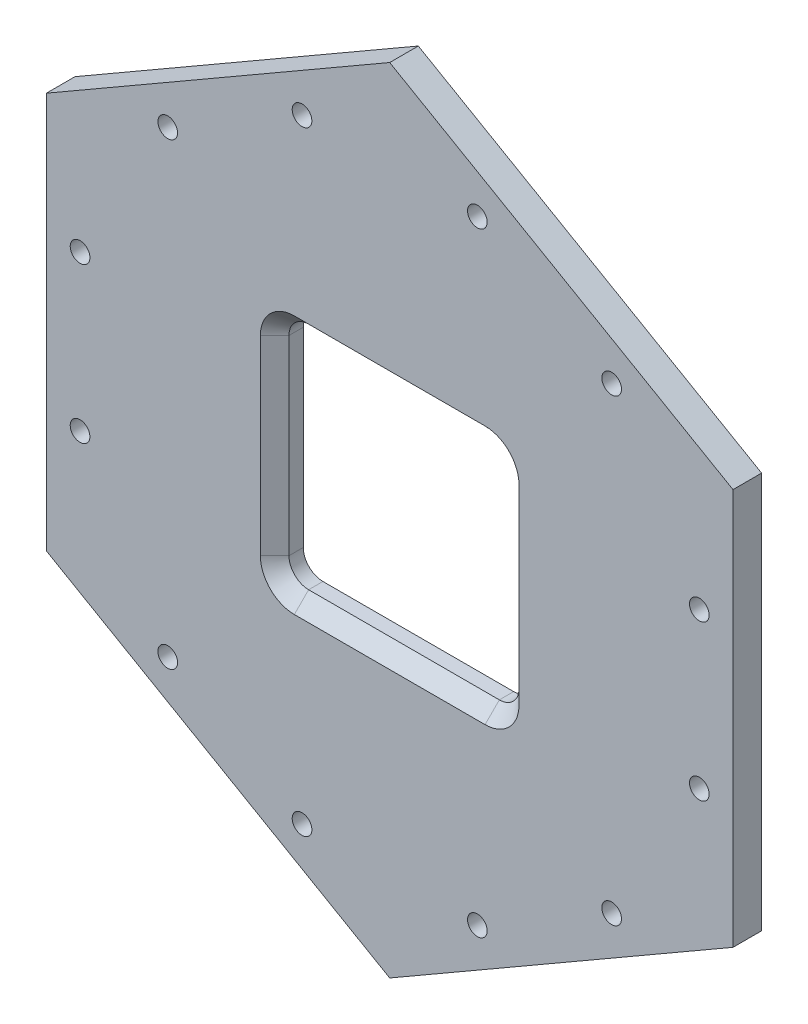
from build123d import *

# Parameters (mm, degrees)
BOSS_EXTRUDE1_DEPTH     = 9.525
CUT_EXTRUDE3_DEPTH      = 350.322151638
CUT_EXTRUDE3_DEPTH_BACK = 350.322151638
CUT_EXTRUDE4_DEPTH      = 350.322151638
CUT_EXTRUDE4_DEPTH_BACK = 350.322151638
SKETCH7_R               = 6.5484375
CHAMFER2_SIZE           = 9.525


with BuildPart() as part:
    # Sketch1 → Boss-Extrude1 (new, symmetric)
    with BuildSketch(Plane(origin=(0, 0, 0), x_dir=(0, -1, 0), z_dir=(0, 0, 1))):
        Polygon((131.982271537, -228.6), (263.964543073, 0), (131.982271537, 228.6), (-131.982271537, 228.6), (-263.964543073, 0), (-131.982271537, -228.6), align=None)
    extrude(amount=BOSS_EXTRUDE1_DEPTH, both=True)

    # Sketch5 → Cut-Extrude3 (cut, two sides: drawn at the far end of the back side and taken through both)
    with BuildSketch(Plane(origin=(0, 0, 0), x_dir=(0, 1, 0), z_dir=(0, 0, 1)).offset(-CUT_EXTRUDE3_DEPTH_BACK)):
        with BuildLine():
            Line((-76.581, 63.5), (-76.581, -63.5))
            ThreePointArc((-76.581, -63.5), (-72.749663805, -72.749663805), (-63.5, -76.581))
            Line((-63.5, -76.581), (63.5, -76.581))
            ThreePointArc((63.5, -76.581), (72.749663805, -72.749663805), (76.581, -63.5))
            Line((76.581, -63.5), (76.581, 63.5))
            ThreePointArc((76.581, 63.5), (72.749663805, 72.749663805), (63.5, 76.581))
            Line((63.5, 76.581), (-63.5, 76.581))
            ThreePointArc((-63.5, 76.581), (-72.749663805, 72.749663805), (-76.581, 63.5))
        make_face()
    extrude(amount=CUT_EXTRUDE3_DEPTH + CUT_EXTRUDE3_DEPTH_BACK, mode=Mode.SUBTRACT)

    # Sketch7 → Cut-Extrude4 (cut, two sides: drawn at the far end of the back side and taken through both)
    with BuildSketch(Plane(origin=(0, 0, 0), x_dir=(0, 1, 0), z_dir=(0, 0, 1)).offset(-CUT_EXTRUDE4_DEPTH_BACK)):
        with Locations(Location((-51.626591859, -206.1765625, 0), (0, 0, 270))):
            Circle(SKETCH7_R)
        with Locations(Location((51.626591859, -206.1765625, 0), (0, 0, 270))):
            Circle(SKETCH7_R)
        with Locations(Location((-204.367436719, -58.37834119, 0), (0, 0, 270))):
            Circle(SKETCH7_R)
        with Locations(Location((-152.740844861, -147.79822131, 0), (0, 0, 270))):
            Circle(SKETCH7_R)
        with Locations(Location((-152.740844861, 147.79822131, 0), (0, 0, 270))):
            Circle(SKETCH7_R)
        with Locations(Location((-204.367436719, 58.37834119, 0), (0, 0, 270))):
            Circle(SKETCH7_R)
        with Locations(Location((51.626591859, 206.1765625, 0), (0, 0, 270))):
            Circle(SKETCH7_R)
        with Locations(Location((-51.626591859, 206.1765625, 0), (0, 0, 270))):
            Circle(SKETCH7_R)
        with Locations(Location((204.367436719, 58.37834119, 0), (0, 0, 270))):
            Circle(SKETCH7_R)
        with Locations(Location((152.740844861, 147.79822131, 0), (0, 0, 270))):
            Circle(SKETCH7_R)
        with Locations(Location((152.740844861, -147.79822131, 0), (0, 0, 270))):
            Circle(SKETCH7_R)
        with Locations(Location((204.367436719, -58.37834119, 0), (0, 0, 270))):
            Circle(SKETCH7_R)
    extrude(amount=CUT_EXTRUDE4_DEPTH + CUT_EXTRUDE4_DEPTH_BACK, mode=Mode.SUBTRACT)

    # Chamfer2
    chamfer2_edges = [part.edges().sort_by_distance(p)[0] for p in [
        (-72.749663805, -72.749663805, 9.525),
        (0, -76.581, 9.525),
        (72.749663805, -72.749663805, 9.525),
        (76.581, 0, 9.525),
        (72.749663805, 72.749663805, 9.525),
        (0, 76.581, 9.525),
        (-72.749663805, 72.749663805, 9.525),
        (-76.581, 0, 9.525),
    ]]
    chamfer(chamfer2_edges, length=CHAMFER2_SIZE)


solid = part.part
